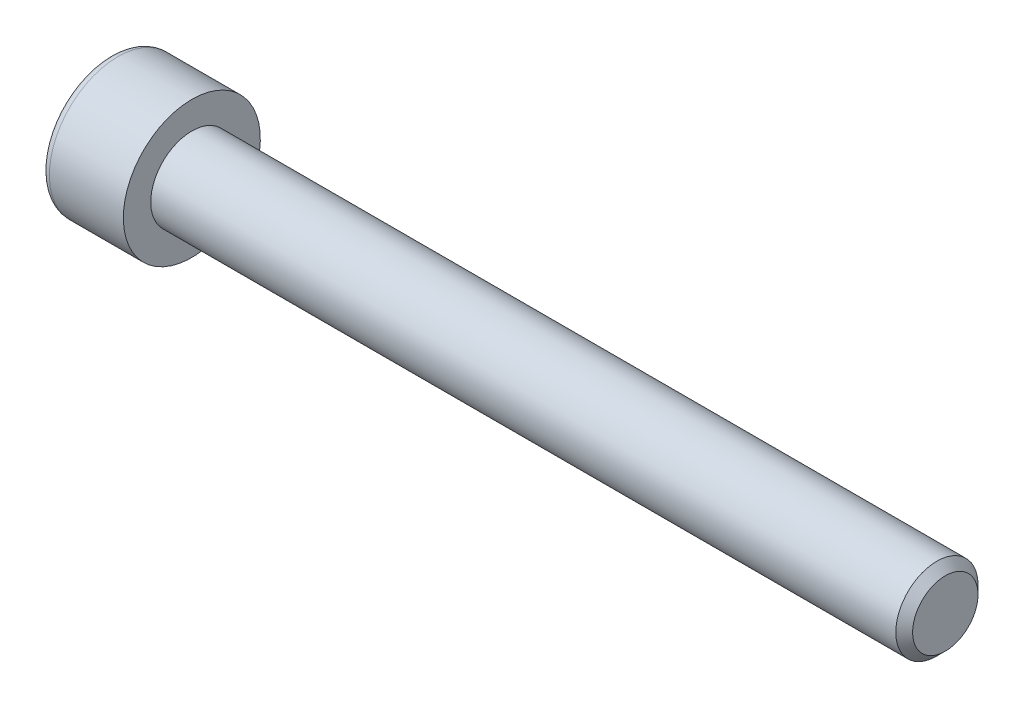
ISO-10303-21;
HEADER;
FILE_DESCRIPTION(('STEP AP214'),'2;1');
FILE_NAME('part.step','',(''),(''),'','','');
FILE_SCHEMA(('AUTOMOTIVE_DESIGN { 1 0 10303 214 1 1 1 1 }'));
ENDSEC;
DATA;
#1=APPLICATION_CONTEXT('core data for automotive mechanical design processes');
#2=APPLICATION_PROTOCOL_DEFINITION('international standard','automotive_design',2000,#1);
#3=PRODUCT_CONTEXT('',#1,'mechanical');
#4=PRODUCT('Part','Part','',(#3));
#5=PRODUCT_RELATED_PRODUCT_CATEGORY('part','',(#4));
#6=PRODUCT_DEFINITION_FORMATION('','',#4);
#7=PRODUCT_DEFINITION_CONTEXT('part definition',#1,'design');
#8=PRODUCT_DEFINITION('design','',#6,#7);
#9=PRODUCT_DEFINITION_SHAPE('','',#8);
#10=(LENGTH_UNIT() NAMED_UNIT(*) SI_UNIT(.MILLI.,.METRE.));
#11=(NAMED_UNIT(*) PLANE_ANGLE_UNIT() SI_UNIT($,.RADIAN.));
#12=(NAMED_UNIT(*) SI_UNIT($,.STERADIAN.) SOLID_ANGLE_UNIT());
#13=UNCERTAINTY_MEASURE_WITH_UNIT(LENGTH_MEASURE(1.E-05),#10,'distance_accuracy_value','');
#14=(GEOMETRIC_REPRESENTATION_CONTEXT(3) GLOBAL_UNCERTAINTY_ASSIGNED_CONTEXT((#13)) GLOBAL_UNIT_ASSIGNED_CONTEXT((#10,
#11,#12)) REPRESENTATION_CONTEXT('',''));
#15=CARTESIAN_POINT('',(0.,0.,0.));
#16=DIRECTION('',(0.,0.,1.));
#17=DIRECTION('',(1.,0.,0.));
#18=AXIS2_PLACEMENT_3D('',#15,#16,#17);
#19=CARTESIAN_POINT('',(-3.0100000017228,0.,0.));
#20=DIRECTION('',(-1.,0.,0.));
#21=DIRECTION('',(0.,0.,1.));
#22=AXIS2_PLACEMENT_3D('',#19,#20,#21);
#23=CONICAL_SURFACE('',#22,2.90407185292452,1.0471975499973);
#24=CARTESIAN_POINT('',(-1.33333333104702,0.,0.));
#25=VERTEX_POINT('',#24);
#26=VERTEX_LOOP('',#25);
#27=FACE_BOUND('',#26,.T.);
#28=CARTESIAN_POINT('',(-3.00000000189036,2.50000000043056,1.44337567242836));
#29=CARTESIAN_POINT('',(-2.96336943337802,2.50000000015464,1.31652043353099));
#30=CARTESIAN_POINT('',(-2.93005584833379,2.50000000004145,1.18857018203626));
#31=CARTESIAN_POINT('',(-2.87190798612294,2.49999999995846,0.930454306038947));
#32=CARTESIAN_POINT('',(-2.84709427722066,2.499999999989,0.800284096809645));
#33=CARTESIAN_POINT('',(-2.80846995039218,2.50000000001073,0.54155681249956));
#34=CARTESIAN_POINT('',(-2.79440223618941,2.50000000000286,0.41303953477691));
#35=CARTESIAN_POINT('',(-2.77761146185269,2.49999999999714,0.155400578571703));
#36=CARTESIAN_POINT('',(-2.77487449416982,2.49999999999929,0.0262798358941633));
#37=CARTESIAN_POINT('',(-2.78058286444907,2.50000000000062,-0.214968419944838));
#38=CARTESIAN_POINT('',(-2.78762660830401,2.50000000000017,-0.327132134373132));
#39=CARTESIAN_POINT('',(-2.80994662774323,2.49999999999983,-0.550728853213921));
#40=CARTESIAN_POINT('',(-2.82523052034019,2.49999999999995,-0.662161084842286));
#41=CARTESIAN_POINT('',(-2.86343729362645,2.50000000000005,-0.886218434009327));
#42=CARTESIAN_POINT('',(-2.88652205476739,2.50000000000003,-0.998815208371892));
#43=CARTESIAN_POINT('',(-2.93891470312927,2.49999999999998,-1.2223298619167));
#44=CARTESIAN_POINT('',(-2.96821028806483,2.49999999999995,-1.33325060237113));
#45=CARTESIAN_POINT('',(-3.00000000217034,2.5,-1.44337567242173));
#46=B_SPLINE_CURVE_WITH_KNOTS('',3,(#28,#29,#30,#31,#32,#33,#34,#35,#36,#37,#38,#39,#40,#41,#42,
#43,#44,#45),.UNSPECIFIED.,.F.,.F.,(4,2,2,2,2,2,2,2,4),(0.,0.396270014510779,0.793492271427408,
1.18088450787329,1.5678011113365,1.90463472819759,2.24178024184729,2.58640202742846,
2.93034746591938),.UNSPECIFIED.);
#47=CARTESIAN_POINT('',(-3.00000000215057,2.49999999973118,1.44337567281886));
#48=VERTEX_POINT('',#47);
#49=CARTESIAN_POINT('',(-3.00000000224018,2.5,-1.44337567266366));
#50=VERTEX_POINT('',#49);
#51=EDGE_CURVE('E20',#48,#50,#46,.T.);
#52=ORIENTED_EDGE('',*,*,#51,.T.);
#53=CARTESIAN_POINT('',(-3.00000000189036,2.49999999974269,-1.4433756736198));
#54=CARTESIAN_POINT('',(-2.96336943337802,2.39014014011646,-1.50680329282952));
#55=CARTESIAN_POINT('',(-2.93005584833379,2.27933197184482,-1.57077841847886));
#56=CARTESIAN_POINT('',(-2.87190798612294,2.05579706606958,-1.69983635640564));
#57=CARTESIAN_POINT('',(-2.84709427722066,1.94306635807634,-1.76492146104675));
#58=CARTESIAN_POINT('',(-2.80846995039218,1.71900195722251,-1.8942851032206));
#59=CARTESIAN_POINT('',(-2.79440223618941,1.60770272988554,-1.95854374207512));
#60=CARTESIAN_POINT('',(-2.77761146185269,1.38458084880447,-2.08736322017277));
#61=CARTESIAN_POINT('',(-2.77487449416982,1.27275900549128,-2.15192359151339));
#62=CARTESIAN_POINT('',(-2.78058286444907,1.06383188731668,-2.27254771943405));
#63=CARTESIAN_POINT('',(-2.78762660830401,0.966695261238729,-2.32862957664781));
#64=CARTESIAN_POINT('',(-2.80994662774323,0.773054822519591,-2.44042793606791));
#65=CARTESIAN_POINT('',(-2.82523052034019,0.676551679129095,-2.4961440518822));
#66=CARTESIAN_POINT('',(-2.86343729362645,0.482512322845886,-2.6081727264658));
#67=CARTESIAN_POINT('',(-2.88652205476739,0.385000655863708,-2.66447111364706));
#68=CARTESIAN_POINT('',(-2.93891470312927,0.191431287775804,-2.77622844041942));
#69=CARTESIAN_POINT('',(-2.96821028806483,0.0953711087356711,-2.83168881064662));
#70=CARTESIAN_POINT('',(-3.00000000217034,4.783387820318E-10,-2.88675134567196));
#71=B_SPLINE_CURVE_WITH_KNOTS('',3,(#53,#54,#55,#56,#57,#58,#59,#60,#61,#62,#63,#64,#65,#66,#67,
#68,#69,#70),.UNSPECIFIED.,.F.,.F.,(4,2,2,2,2,2,2,2,4),(0.,0.396270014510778,0.793492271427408,
1.18088450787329,1.5678011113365,1.90463472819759,2.24178024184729,2.58640202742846,
2.93034746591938),.UNSPECIFIED.);
#72=CARTESIAN_POINT('',(-3.00000000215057,0.,-2.88675134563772));
#73=VERTEX_POINT('',#72);
#74=EDGE_CURVE('E80',#50,#73,#71,.T.);
#75=ORIENTED_EDGE('',*,*,#74,.T.);
#76=CARTESIAN_POINT('',(-3.00000000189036,-6.87877142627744E-10,-2.88675134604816));
#77=CARTESIAN_POINT('',(-2.96336943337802,-0.10985986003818,-2.82332372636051));
#78=CARTESIAN_POINT('',(-2.93005584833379,-0.220668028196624,-2.75934860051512));
#79=CARTESIAN_POINT('',(-2.87190798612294,-0.444202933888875,-2.63029066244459));
#80=CARTESIAN_POINT('',(-2.84709427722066,-0.55693364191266,-2.5652055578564));
#81=CARTESIAN_POINT('',(-2.80846995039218,-0.780998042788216,-2.43584191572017));
#82=CARTESIAN_POINT('',(-2.79440223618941,-0.892297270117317,-2.37158327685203));
#83=CARTESIAN_POINT('',(-2.77761146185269,-1.11541915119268,-2.24276379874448));
#84=CARTESIAN_POINT('',(-2.77487449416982,-1.22724099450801,-2.17820342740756));
#85=CARTESIAN_POINT('',(-2.78058286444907,-1.43616811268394,-2.05757929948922));
#86=CARTESIAN_POINT('',(-2.78762660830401,-1.53330473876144,-2.00149744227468));
#87=CARTESIAN_POINT('',(-2.80994662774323,-1.72694517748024,-1.88969908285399));
#88=CARTESIAN_POINT('',(-2.82523052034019,-1.82344832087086,-1.83398296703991));
#89=CARTESIAN_POINT('',(-2.86343729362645,-2.01748767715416,-1.72195429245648));
#90=CARTESIAN_POINT('',(-2.88652205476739,-2.11499934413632,-1.66565590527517));
#91=CARTESIAN_POINT('',(-2.93891470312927,-2.30856871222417,-1.55389857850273));
#92=CARTESIAN_POINT('',(-2.96821028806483,-2.40462889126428,-1.49843820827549));
#93=CARTESIAN_POINT('',(-3.00000000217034,-2.49999999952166,-1.44337567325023));
#94=B_SPLINE_CURVE_WITH_KNOTS('',3,(#76,#77,#78,#79,#80,#81,#82,#83,#84,#85,#86,#87,#88,#89,#90,
#91,#92,#93),.UNSPECIFIED.,.F.,.F.,(4,2,2,2,2,2,2,2,4),(0.,0.396270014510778,0.793492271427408,
1.18088450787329,1.5678011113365,1.90463472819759,2.24178024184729,2.58640202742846,
2.93034746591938),.UNSPECIFIED.);
#95=CARTESIAN_POINT('',(-3.00000000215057,-2.49999999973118,-1.44337567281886));
#96=VERTEX_POINT('',#95);
#97=EDGE_CURVE('E105',#73,#96,#94,.T.);
#98=ORIENTED_EDGE('',*,*,#97,.T.);
#99=CARTESIAN_POINT('',(-3.00000000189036,-2.50000000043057,-1.44337567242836));
#100=CARTESIAN_POINT('',(-2.96336943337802,-2.50000000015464,-1.31652043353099));
#101=CARTESIAN_POINT('',(-2.93005584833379,-2.50000000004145,-1.18857018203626));
#102=CARTESIAN_POINT('',(-2.87190798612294,-2.49999999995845,-0.930454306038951));
#103=CARTESIAN_POINT('',(-2.84709427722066,-2.499999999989,-0.800284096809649));
#104=CARTESIAN_POINT('',(-2.80846995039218,-2.50000000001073,-0.541556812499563));
#105=CARTESIAN_POINT('',(-2.79440223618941,-2.50000000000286,-0.413039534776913));
#106=CARTESIAN_POINT('',(-2.77761146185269,-2.49999999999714,-0.155400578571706));
#107=CARTESIAN_POINT('',(-2.77487449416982,-2.49999999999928,-0.0262798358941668));
#108=CARTESIAN_POINT('',(-2.78058286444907,-2.50000000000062,0.214968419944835));
#109=CARTESIAN_POINT('',(-2.78762660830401,-2.50000000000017,0.327132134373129));
#110=CARTESIAN_POINT('',(-2.80994662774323,-2.49999999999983,0.550728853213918));
#111=CARTESIAN_POINT('',(-2.82523052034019,-2.49999999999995,0.662161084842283));
#112=CARTESIAN_POINT('',(-2.86343729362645,-2.50000000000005,0.886218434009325));
#113=CARTESIAN_POINT('',(-2.88652205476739,-2.50000000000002,0.99881520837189));
#114=CARTESIAN_POINT('',(-2.93891470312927,-2.49999999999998,1.2223298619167));
#115=CARTESIAN_POINT('',(-2.96821028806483,-2.49999999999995,1.33325060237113));
#116=CARTESIAN_POINT('',(-3.00000000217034,-2.5,1.44337567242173));
#117=B_SPLINE_CURVE_WITH_KNOTS('',3,(#99,#100,#101,#102,#103,#104,#105,#106,#107,#108,#109,#110,
#111,#112,#113,#114,#115,#116),.UNSPECIFIED.,.F.,.F.,(4,2,2,2,2,2,2,2,4),(0.,0.396270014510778,
0.793492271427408,1.18088450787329,1.5678011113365,1.90463472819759,2.24178024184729,
2.58640202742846,2.93034746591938),.UNSPECIFIED.);
#118=CARTESIAN_POINT('',(-3.00000000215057,-2.49999999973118,1.44337567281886));
#119=VERTEX_POINT('',#118);
#120=EDGE_CURVE('E129',#96,#119,#117,.T.);
#121=ORIENTED_EDGE('',*,*,#120,.T.);
#122=CARTESIAN_POINT('',(-3.00000000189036,-2.49999999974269,1.4433756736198));
#123=CARTESIAN_POINT('',(-2.96336943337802,-2.39014014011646,1.50680329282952));
#124=CARTESIAN_POINT('',(-2.93005584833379,-2.27933197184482,1.57077841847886));
#125=CARTESIAN_POINT('',(-2.87190798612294,-2.05579706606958,1.69983635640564));
#126=CARTESIAN_POINT('',(-2.84709427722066,-1.94306635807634,1.76492146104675));
#127=CARTESIAN_POINT('',(-2.80846995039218,-1.71900195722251,1.8942851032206));
#128=CARTESIAN_POINT('',(-2.79440223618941,-1.60770272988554,1.95854374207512));
#129=CARTESIAN_POINT('',(-2.77761146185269,-1.38458084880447,2.08736322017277));
#130=CARTESIAN_POINT('',(-2.77487449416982,-1.27275900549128,2.15192359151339));
#131=CARTESIAN_POINT('',(-2.78058286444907,-1.06383188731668,2.27254771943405));
#132=CARTESIAN_POINT('',(-2.78762660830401,-0.96669526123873,2.32862957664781));
#133=CARTESIAN_POINT('',(-2.80994662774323,-0.773054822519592,2.44042793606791));
#134=CARTESIAN_POINT('',(-2.82523052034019,-0.676551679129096,2.4961440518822));
#135=CARTESIAN_POINT('',(-2.86343729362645,-0.482512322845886,2.6081727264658));
#136=CARTESIAN_POINT('',(-2.88652205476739,-0.385000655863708,2.66447111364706));
#137=CARTESIAN_POINT('',(-2.93891470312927,-0.191431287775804,2.77622844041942));
#138=CARTESIAN_POINT('',(-2.96821028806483,-0.0953711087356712,2.83168881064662));
#139=CARTESIAN_POINT('',(-3.00000000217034,-4.78339193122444E-10,2.88675134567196));
#140=B_SPLINE_CURVE_WITH_KNOTS('',3,(#122,#123,#124,#125,#126,#127,#128,#129,#130,#131,#132,
#133,#134,#135,#136,#137,#138,#139),.UNSPECIFIED.,.F.,.F.,(4,2,2,2,2,2,2,2,4),(0.,
0.396270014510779,0.793492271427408,1.18088450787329,1.5678011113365,1.90463472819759,
2.24178024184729,2.58640202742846,2.93034746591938),.UNSPECIFIED.);
#141=CARTESIAN_POINT('',(-3.00000000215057,0.,2.88675134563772));
#142=VERTEX_POINT('',#141);
#143=EDGE_CURVE('E137',#119,#142,#140,.T.);
#144=ORIENTED_EDGE('',*,*,#143,.T.);
#145=CARTESIAN_POINT('',(-3.00000000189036,6.87876588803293E-10,2.88675134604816));
#146=CARTESIAN_POINT('',(-2.96336943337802,0.109859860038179,2.82332372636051));
#147=CARTESIAN_POINT('',(-2.93005584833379,0.220668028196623,2.75934860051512));
#148=CARTESIAN_POINT('',(-2.87190798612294,0.444202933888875,2.63029066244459));
#149=CARTESIAN_POINT('',(-2.84709427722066,0.556933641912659,2.5652055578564));
#150=CARTESIAN_POINT('',(-2.80846995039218,0.780998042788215,2.43584191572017));
#151=CARTESIAN_POINT('',(-2.79440223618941,0.892297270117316,2.37158327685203));
#152=CARTESIAN_POINT('',(-2.77761146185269,1.11541915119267,2.24276379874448));
#153=CARTESIAN_POINT('',(-2.77487449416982,1.22724099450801,2.17820342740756));
#154=CARTESIAN_POINT('',(-2.78058286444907,1.43616811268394,2.05757929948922));
#155=CARTESIAN_POINT('',(-2.78762660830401,1.53330473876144,2.00149744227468));
#156=CARTESIAN_POINT('',(-2.80994662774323,1.72694517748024,1.88969908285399));
#157=CARTESIAN_POINT('',(-2.82523052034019,1.82344832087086,1.83398296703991));
#158=CARTESIAN_POINT('',(-2.86343729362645,2.01748767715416,1.72195429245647));
#159=CARTESIAN_POINT('',(-2.88652205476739,2.11499934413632,1.66565590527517));
#160=CARTESIAN_POINT('',(-2.93891470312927,2.30856871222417,1.55389857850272));
#161=CARTESIAN_POINT('',(-2.96821028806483,2.40462889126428,1.49843820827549));
#162=CARTESIAN_POINT('',(-3.00000000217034,2.49999999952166,1.44337567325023));
#163=B_SPLINE_CURVE_WITH_KNOTS('',3,(#145,#146,#147,#148,#149,#150,#151,#152,#153,#154,#155,
#156,#157,#158,#159,#160,#161,#162),.UNSPECIFIED.,.F.,.F.,(4,2,2,2,2,2,2,2,4),(0.,
0.396270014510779,0.793492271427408,1.18088450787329,1.5678011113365,1.90463472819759,
2.24178024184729,2.58640202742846,2.93034746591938),.UNSPECIFIED.);
#164=EDGE_CURVE('E82',#142,#48,#163,.T.);
#165=ORIENTED_EDGE('',*,*,#164,.T.);
#166=EDGE_LOOP('',(#52,#75,#98,#121,#144,#165));
#167=FACE_BOUND('',#166,.T.);
#168=ADVANCED_FACE('F16',(#27,#167),#23,.F.);
#169=CARTESIAN_POINT('',(-6.,2.5,1.44337567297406));
#170=DIRECTION('',(0.,1.,0.));
#171=DIRECTION('',(0.,0.,1.));
#172=AXIS2_PLACEMENT_3D('',#169,#170,#171);
#173=PLANE('',#172);
#174=DIRECTION('',(1.,0.,0.));
#175=VECTOR('',#174,1.);
#176=CARTESIAN_POINT('',(-6.,2.5,1.44337567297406));
#177=LINE('',#176,#175);
#178=CARTESIAN_POINT('',(-6.,2.5,1.44337567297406));
#179=VERTEX_POINT('',#178);
#180=EDGE_CURVE('E84',#48,#179,#177,.F.);
#181=ORIENTED_EDGE('',*,*,#180,.T.);
#182=DIRECTION('',(0.,0.,1.));
#183=VECTOR('',#182,1.);
#184=CARTESIAN_POINT('',(-6.,2.5,0.));
#185=LINE('',#184,#183);
#186=CARTESIAN_POINT('',(-6.,2.5,-1.44337567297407));
#187=VERTEX_POINT('',#186);
#188=EDGE_CURVE('E89',#187,#179,#185,.T.);
#189=ORIENTED_EDGE('',*,*,#188,.F.);
#190=DIRECTION('',(1.,0.,0.));
#191=VECTOR('',#190,1.);
#192=CARTESIAN_POINT('',(-6.,2.5,-1.44337567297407));
#193=LINE('',#192,#191);
#194=EDGE_CURVE('E87',#187,#50,#193,.T.);
#195=ORIENTED_EDGE('',*,*,#194,.T.);
#196=ORIENTED_EDGE('',*,*,#51,.F.);
#197=EDGE_LOOP('',(#181,#189,#195,#196));
#198=FACE_BOUND('',#197,.T.);
#199=ADVANCED_FACE('F76',(#198),#173,.F.);
#200=CARTESIAN_POINT('',(-6.,0.,2.88675134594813));
#201=DIRECTION('',(0.,0.500000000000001,0.866025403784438));
#202=DIRECTION('',(0.,-0.866025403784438,0.500000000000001));
#203=AXIS2_PLACEMENT_3D('',#200,#201,#202);
#204=PLANE('',#203);
#205=DIRECTION('',(1.,0.,0.));
#206=VECTOR('',#205,1.);
#207=CARTESIAN_POINT('',(-6.,0.,2.88675134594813));
#208=LINE('',#207,#206);
#209=CARTESIAN_POINT('',(-6.,0.,2.88675134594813));
#210=VERTEX_POINT('',#209);
#211=EDGE_CURVE('E141',#142,#210,#208,.F.);
#212=ORIENTED_EDGE('',*,*,#211,.T.);
#213=DIRECTION('',(0.,-0.866025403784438,0.500000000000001));
#214=VECTOR('',#213,1.);
#215=CARTESIAN_POINT('',(-6.,2.5,1.44337567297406));
#216=LINE('',#215,#214);
#217=EDGE_CURVE('E95',#179,#210,#216,.T.);
#218=ORIENTED_EDGE('',*,*,#217,.F.);
#219=ORIENTED_EDGE('',*,*,#180,.F.);
#220=ORIENTED_EDGE('',*,*,#164,.F.);
#221=EDGE_LOOP('',(#212,#218,#219,#220));
#222=FACE_BOUND('',#221,.T.);
#223=ADVANCED_FACE('F145',(#222),#204,.F.);
#224=CARTESIAN_POINT('',(-6.,-2.5,1.44337567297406));
#225=DIRECTION('',(0.,-0.5,0.866025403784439));
#226=DIRECTION('',(0.,-0.866025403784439,-0.5));
#227=AXIS2_PLACEMENT_3D('',#224,#225,#226);
#228=PLANE('',#227);
#229=DIRECTION('',(1.,0.,0.));
#230=VECTOR('',#229,1.);
#231=CARTESIAN_POINT('',(-6.,-2.5,1.44337567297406));
#232=LINE('',#231,#230);
#233=CARTESIAN_POINT('',(-6.,-2.5,1.44337567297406));
#234=VERTEX_POINT('',#233);
#235=EDGE_CURVE('E136',#119,#234,#232,.F.);
#236=ORIENTED_EDGE('',*,*,#235,.T.);
#237=DIRECTION('',(0.,-0.866025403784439,-0.5));
#238=VECTOR('',#237,1.);
#239=CARTESIAN_POINT('',(-6.,0.,2.88675134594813));
#240=LINE('',#239,#238);
#241=EDGE_CURVE('E224',#210,#234,#240,.T.);
#242=ORIENTED_EDGE('',*,*,#241,.F.);
#243=ORIENTED_EDGE('',*,*,#211,.F.);
#244=ORIENTED_EDGE('',*,*,#143,.F.);
#245=EDGE_LOOP('',(#236,#242,#243,#244));
#246=FACE_BOUND('',#245,.T.);
#247=ADVANCED_FACE('F125',(#246),#228,.F.);
#248=CARTESIAN_POINT('',(-6.,-2.5,-1.44337567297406));
#249=DIRECTION('',(0.,-1.,0.));
#250=DIRECTION('',(0.,0.,-1.));
#251=AXIS2_PLACEMENT_3D('',#248,#249,#250);
#252=PLANE('',#251);
#253=DIRECTION('',(1.,0.,0.));
#254=VECTOR('',#253,1.);
#255=CARTESIAN_POINT('',(-6.,-2.5,-1.44337567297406));
#256=LINE('',#255,#254);
#257=CARTESIAN_POINT('',(-6.,-2.5,-1.44337567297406));
#258=VERTEX_POINT('',#257);
#259=EDGE_CURVE('E135',#96,#258,#256,.F.);
#260=ORIENTED_EDGE('',*,*,#259,.T.);
#261=DIRECTION('',(0.,0.,1.));
#262=VECTOR('',#261,1.);
#263=CARTESIAN_POINT('',(-6.,-2.5,0.));
#264=LINE('',#263,#262);
#265=EDGE_CURVE('E221',#234,#258,#264,.F.);
#266=ORIENTED_EDGE('',*,*,#265,.F.);
#267=ORIENTED_EDGE('',*,*,#235,.F.);
#268=ORIENTED_EDGE('',*,*,#120,.F.);
#269=EDGE_LOOP('',(#260,#266,#267,#268));
#270=FACE_BOUND('',#269,.T.);
#271=ADVANCED_FACE('F121',(#270),#252,.F.);
#272=CARTESIAN_POINT('',(-6.,0.,-2.88675134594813));
#273=DIRECTION('',(0.,-0.5,-0.866025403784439));
#274=DIRECTION('',(0.,0.866025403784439,-0.5));
#275=AXIS2_PLACEMENT_3D('',#272,#273,#274);
#276=PLANE('',#275);
#277=DIRECTION('',(1.,0.,0.));
#278=VECTOR('',#277,1.);
#279=CARTESIAN_POINT('',(-6.,0.,-2.88675134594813));
#280=LINE('',#279,#278);
#281=CARTESIAN_POINT('',(-6.,0.,-2.88675134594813));
#282=VERTEX_POINT('',#281);
#283=EDGE_CURVE('E38',#73,#282,#280,.F.);
#284=ORIENTED_EDGE('',*,*,#283,.T.);
#285=DIRECTION('',(0.,0.866025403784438,-0.500000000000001));
#286=VECTOR('',#285,1.);
#287=CARTESIAN_POINT('',(-6.,-2.5,-1.44337567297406));
#288=LINE('',#287,#286);
#289=EDGE_CURVE('E218',#258,#282,#288,.T.);
#290=ORIENTED_EDGE('',*,*,#289,.F.);
#291=ORIENTED_EDGE('',*,*,#259,.F.);
#292=ORIENTED_EDGE('',*,*,#97,.F.);
#293=EDGE_LOOP('',(#284,#290,#291,#292));
#294=FACE_BOUND('',#293,.T.);
#295=ADVANCED_FACE('F115',(#294),#276,.F.);
#296=CARTESIAN_POINT('',(-6.,2.5,-1.44337567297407));
#297=DIRECTION('',(0.,0.5,-0.866025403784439));
#298=DIRECTION('',(0.,0.866025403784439,0.5));
#299=AXIS2_PLACEMENT_3D('',#296,#297,#298);
#300=PLANE('',#299);
#301=ORIENTED_EDGE('',*,*,#194,.F.);
#302=DIRECTION('',(0.,0.866025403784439,0.5));
#303=VECTOR('',#302,1.);
#304=CARTESIAN_POINT('',(-6.,0.,-2.88675134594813));
#305=LINE('',#304,#303);
#306=EDGE_CURVE('E216',#282,#187,#305,.T.);
#307=ORIENTED_EDGE('',*,*,#306,.F.);
#308=ORIENTED_EDGE('',*,*,#283,.F.);
#309=ORIENTED_EDGE('',*,*,#74,.F.);
#310=EDGE_LOOP('',(#301,#307,#308,#309));
#311=FACE_BOUND('',#310,.T.);
#312=ADVANCED_FACE('F93',(#311),#300,.F.);
#313=CARTESIAN_POINT('',(-6.,3.94337567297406,0.));
#314=DIRECTION('',(-1.,0.,0.));
#315=DIRECTION('',(0.,0.,1.));
#316=AXIS2_PLACEMENT_3D('',#313,#314,#315);
#317=PLANE('',#316);
#318=ORIENTED_EDGE('',*,*,#289,.T.);
#319=ORIENTED_EDGE('',*,*,#306,.T.);
#320=ORIENTED_EDGE('',*,*,#188,.T.);
#321=ORIENTED_EDGE('',*,*,#217,.T.);
#322=ORIENTED_EDGE('',*,*,#241,.T.);
#323=ORIENTED_EDGE('',*,*,#265,.T.);
#324=EDGE_LOOP('',(#318,#319,#320,#321,#322,#323));
#325=FACE_BOUND('',#324,.T.);
#326=CARTESIAN_POINT('',(-6.,0.,0.));
#327=DIRECTION('',(1.,0.,0.));
#328=DIRECTION('',(0.,1.,0.));
#329=AXIS2_PLACEMENT_3D('',#326,#327,#328);
#330=CIRCLE('',#329,4.4);
#331=CARTESIAN_POINT('',(-6.,4.4,0.));
#332=VERTEX_POINT('',#331);
#333=EDGE_CURVE('E193',#332,#332,#330,.T.);
#334=ORIENTED_EDGE('',*,*,#333,.F.);
#335=EDGE_LOOP('',(#334));
#336=FACE_BOUND('',#335,.T.);
#337=ADVANCED_FACE('F114',(#325,#336),#317,.T.);
#338=CARTESIAN_POINT('',(-5.4,0.,0.));
#339=DIRECTION('',(1.,0.,0.));
#340=DIRECTION('',(0.,0.,-1.));
#341=AXIS2_PLACEMENT_3D('',#338,#339,#340);
#342=TOROIDAL_SURFACE('',#341,4.4,0.6);
#343=CARTESIAN_POINT('',(-5.4,0.,0.));
#344=DIRECTION('',(1.,0.,0.));
#345=DIRECTION('',(0.,1.,0.));
#346=AXIS2_PLACEMENT_3D('',#343,#344,#345);
#347=CIRCLE('',#346,5.);
#348=CARTESIAN_POINT('',(-5.4,5.,0.));
#349=VERTEX_POINT('',#348);
#350=EDGE_CURVE('E234',#349,#349,#347,.T.);
#351=ORIENTED_EDGE('',*,*,#350,.F.);
#352=EDGE_LOOP('',(#351));
#353=FACE_BOUND('',#352,.T.);
#354=ORIENTED_EDGE('',*,*,#333,.T.);
#355=EDGE_LOOP('',(#354));
#356=FACE_BOUND('',#355,.T.);
#357=ADVANCED_FACE('F177',(#353,#356),#342,.T.);
#358=CARTESIAN_POINT('',(-3.,0.,0.));
#359=DIRECTION('',(1.,0.,0.));
#360=DIRECTION('',(0.,1.,0.));
#361=AXIS2_PLACEMENT_3D('',#358,#359,#360);
#362=CYLINDRICAL_SURFACE('',#361,5.);
#363=ORIENTED_EDGE('',*,*,#350,.T.);
#364=EDGE_LOOP('',(#363));
#365=FACE_BOUND('',#364,.T.);
#366=CARTESIAN_POINT('',(0.,0.,0.));
#367=DIRECTION('',(1.,0.,0.));
#368=DIRECTION('',(0.,1.,0.));
#369=AXIS2_PLACEMENT_3D('',#366,#367,#368);
#370=CIRCLE('',#369,5.);
#371=CARTESIAN_POINT('',(0.,5.,0.));
#372=VERTEX_POINT('',#371);
#373=EDGE_CURVE('E103',#372,#372,#370,.T.);
#374=ORIENTED_EDGE('',*,*,#373,.F.);
#375=EDGE_LOOP('',(#374));
#376=FACE_BOUND('',#375,.T.);
#377=ADVANCED_FACE('F174',(#365,#376),#362,.T.);
#378=CARTESIAN_POINT('',(55.,1.5,0.));
#379=DIRECTION('',(1.,0.,0.));
#380=DIRECTION('',(0.,0.,-1.));
#381=AXIS2_PLACEMENT_3D('',#378,#379,#380);
#382=PLANE('',#381);
#383=CARTESIAN_POINT('',(55.000000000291,0.,0.));
#384=DIRECTION('',(-1.,0.,0.));
#385=DIRECTION('',(0.,0.,1.));
#386=AXIS2_PLACEMENT_3D('',#383,#384,#385);
#387=CIRCLE('',#386,2.38655000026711);
#388=CARTESIAN_POINT('',(55.000000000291,0.,2.38655000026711));
#389=VERTEX_POINT('',#388);
#390=EDGE_CURVE('E230',#389,#389,#387,.T.);
#391=ORIENTED_EDGE('',*,*,#390,.F.);
#392=EDGE_LOOP('',(#391));
#393=FACE_BOUND('',#392,.T.);
#394=ADVANCED_FACE('F170',(#393),#382,.T.);
#395=CARTESIAN_POINT('',(0.,4.,0.));
#396=DIRECTION('',(1.,0.,0.));
#397=DIRECTION('',(0.,0.,-1.));
#398=AXIS2_PLACEMENT_3D('',#395,#396,#397);
#399=PLANE('',#398);
#400=CARTESIAN_POINT('',(0.,0.,0.));
#401=DIRECTION('',(1.,0.,0.));
#402=DIRECTION('',(0.,1.,0.));
#403=AXIS2_PLACEMENT_3D('',#400,#401,#402);
#404=CIRCLE('',#403,3.);
#405=CARTESIAN_POINT('',(0.,3.,0.));
#406=VERTEX_POINT('',#405);
#407=EDGE_CURVE('E29',#406,#406,#404,.T.);
#408=ORIENTED_EDGE('',*,*,#407,.F.);
#409=EDGE_LOOP('',(#408));
#410=FACE_BOUND('',#409,.T.);
#411=ORIENTED_EDGE('',*,*,#373,.T.);
#412=EDGE_LOOP('',(#411));
#413=FACE_BOUND('',#412,.T.);
#414=ADVANCED_FACE('F163',(#410,#413),#399,.T.);
#415=CARTESIAN_POINT('',(54.3865499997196,0.,0.));
#416=DIRECTION('',(-1.,0.,0.));
#417=DIRECTION('',(0.,0.,1.));
#418=AXIS2_PLACEMENT_3D('',#415,#416,#417);
#419=CONICAL_SURFACE('',#418,2.99999999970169,0.78539816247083);
#420=ORIENTED_EDGE('',*,*,#390,.T.);
#421=EDGE_LOOP('',(#420));
#422=FACE_BOUND('',#421,.T.);
#423=CARTESIAN_POINT('',(54.38655,0.,0.));
#424=DIRECTION('',(1.,0.,0.));
#425=DIRECTION('',(0.,1.,0.));
#426=AXIS2_PLACEMENT_3D('',#423,#424,#425);
#427=CIRCLE('',#426,3.);
#428=CARTESIAN_POINT('',(54.38655,3.,0.));
#429=VERTEX_POINT('',#428);
#430=EDGE_CURVE('E11',#429,#429,#427,.F.);
#431=ORIENTED_EDGE('',*,*,#430,.F.);
#432=EDGE_LOOP('',(#431));
#433=FACE_BOUND('',#432,.T.);
#434=ADVANCED_FACE('F156',(#422,#433),#419,.T.);
#435=CARTESIAN_POINT('',(43.,0.,0.));
#436=DIRECTION('',(1.,0.,0.));
#437=DIRECTION('',(0.,1.,0.));
#438=AXIS2_PLACEMENT_3D('',#435,#436,#437);
#439=CYLINDRICAL_SURFACE('',#438,3.);
#440=ORIENTED_EDGE('',*,*,#430,.T.);
#441=EDGE_LOOP('',(#440));
#442=FACE_BOUND('',#441,.T.);
#443=ORIENTED_EDGE('',*,*,#407,.T.);
#444=EDGE_LOOP('',(#443));
#445=FACE_BOUND('',#444,.T.);
#446=ADVANCED_FACE('F154',(#442,#445),#439,.T.);
#447=CLOSED_SHELL('',(#168,#199,#223,#247,#271,#295,#312,#337,#357,#377,#394,#414,#434,#446));
#448=MANIFOLD_SOLID_BREP('B1',#447);
#449=ADVANCED_BREP_SHAPE_REPRESENTATION('',(#18,#448),#14);
#450=SHAPE_DEFINITION_REPRESENTATION(#9,#449);
ENDSEC;
END-ISO-10303-21;
